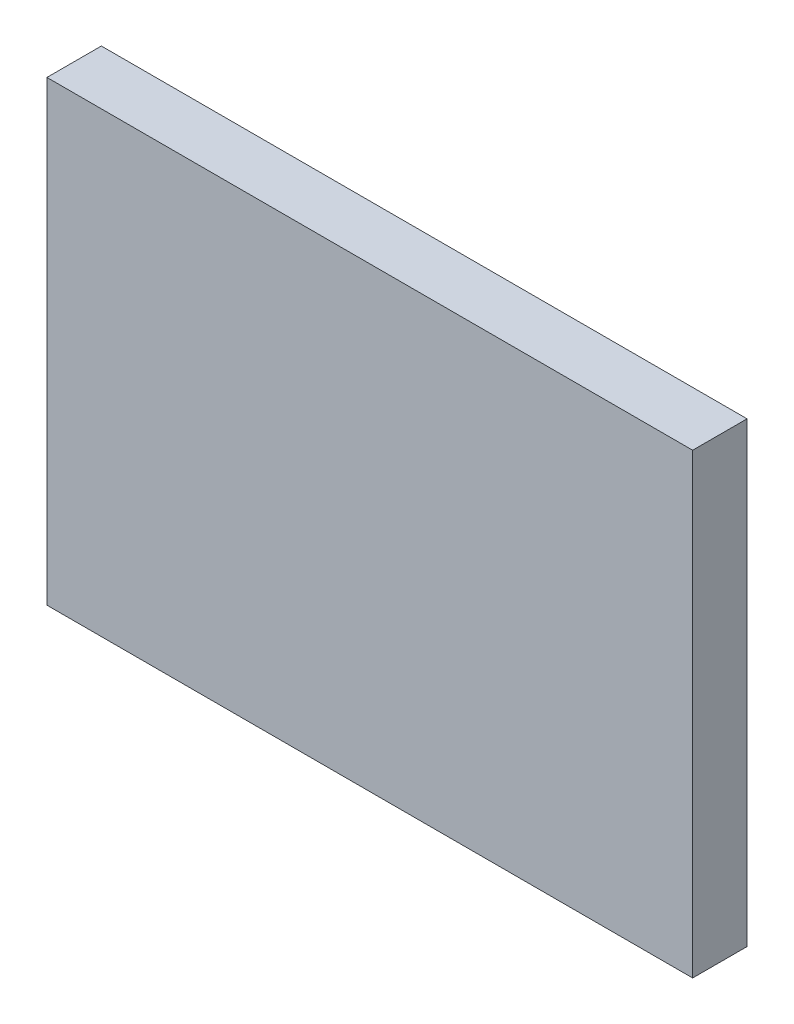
ISO-10303-21;
HEADER;
FILE_DESCRIPTION(('STEP AP214'),'2;1');
FILE_NAME('part.step','',(''),(''),'','','');
FILE_SCHEMA(('AUTOMOTIVE_DESIGN { 1 0 10303 214 1 1 1 1 }'));
ENDSEC;
DATA;
#1=APPLICATION_CONTEXT('core data for automotive mechanical design processes');
#2=APPLICATION_PROTOCOL_DEFINITION('international standard','automotive_design',2000,#1);
#3=PRODUCT_CONTEXT('',#1,'mechanical');
#4=PRODUCT('Part','Part','',(#3));
#5=PRODUCT_RELATED_PRODUCT_CATEGORY('part','',(#4));
#6=PRODUCT_DEFINITION_FORMATION('','',#4);
#7=PRODUCT_DEFINITION_CONTEXT('part definition',#1,'design');
#8=PRODUCT_DEFINITION('design','',#6,#7);
#9=PRODUCT_DEFINITION_SHAPE('','',#8);
#10=(LENGTH_UNIT() NAMED_UNIT(*) SI_UNIT(.MILLI.,.METRE.));
#11=(NAMED_UNIT(*) PLANE_ANGLE_UNIT() SI_UNIT($,.RADIAN.));
#12=(NAMED_UNIT(*) SI_UNIT($,.STERADIAN.) SOLID_ANGLE_UNIT());
#13=UNCERTAINTY_MEASURE_WITH_UNIT(LENGTH_MEASURE(1.E-05),#10,'distance_accuracy_value','');
#14=(GEOMETRIC_REPRESENTATION_CONTEXT(3) GLOBAL_UNCERTAINTY_ASSIGNED_CONTEXT((#13)) GLOBAL_UNIT_ASSIGNED_CONTEXT((#10,
#11,#12)) REPRESENTATION_CONTEXT('',''));
#15=CARTESIAN_POINT('',(0.,0.,0.));
#16=DIRECTION('',(0.,0.,1.));
#17=DIRECTION('',(1.,0.,0.));
#18=AXIS2_PLACEMENT_3D('',#15,#16,#17);
#19=CARTESIAN_POINT('',(17.8,12.6,3.));
#20=DIRECTION('',(-1.,0.,0.));
#21=DIRECTION('',(0.,-1.,0.));
#22=AXIS2_PLACEMENT_3D('',#19,#20,#21);
#23=PLANE('',#22);
#24=DIRECTION('',(0.,1.,0.));
#25=VECTOR('',#24,1.);
#26=CARTESIAN_POINT('',(17.8,12.6,0.));
#27=LINE('',#26,#25);
#28=CARTESIAN_POINT('',(17.8,-12.6,0.));
#29=VERTEX_POINT('',#28);
#30=CARTESIAN_POINT('',(17.8,12.6,0.));
#31=VERTEX_POINT('',#30);
#32=EDGE_CURVE('E95',#29,#31,#27,.T.);
#33=ORIENTED_EDGE('',*,*,#32,.T.);
#34=DIRECTION('',(0.,0.,-1.));
#35=VECTOR('',#34,1.);
#36=CARTESIAN_POINT('',(17.8,12.6,3.));
#37=LINE('',#36,#35);
#38=CARTESIAN_POINT('',(17.8,12.6,3.));
#39=VERTEX_POINT('',#38);
#40=EDGE_CURVE('E11',#39,#31,#37,.T.);
#41=ORIENTED_EDGE('',*,*,#40,.F.);
#42=DIRECTION('',(0.,1.,0.));
#43=VECTOR('',#42,1.);
#44=CARTESIAN_POINT('',(17.8,12.6,3.));
#45=LINE('',#44,#43);
#46=CARTESIAN_POINT('',(17.8,-12.6,3.));
#47=VERTEX_POINT('',#46);
#48=EDGE_CURVE('E83',#47,#39,#45,.T.);
#49=ORIENTED_EDGE('',*,*,#48,.F.);
#50=DIRECTION('',(0.,0.,-1.));
#51=VECTOR('',#50,1.);
#52=CARTESIAN_POINT('',(17.8,-12.6,3.));
#53=LINE('',#52,#51);
#54=EDGE_CURVE('E91',#47,#29,#53,.T.);
#55=ORIENTED_EDGE('',*,*,#54,.T.);
#56=EDGE_LOOP('',(#33,#41,#49,#55));
#57=FACE_BOUND('',#56,.T.);
#58=ADVANCED_FACE('F32',(#57),#23,.F.);
#59=CARTESIAN_POINT('',(-17.8,12.6,3.));
#60=DIRECTION('',(0.,-1.,0.));
#61=DIRECTION('',(0.,0.,-1.));
#62=AXIS2_PLACEMENT_3D('',#59,#60,#61);
#63=PLANE('',#62);
#64=DIRECTION('',(-1.,0.,0.));
#65=VECTOR('',#64,1.);
#66=CARTESIAN_POINT('',(-17.8,12.6,0.));
#67=LINE('',#66,#65);
#68=CARTESIAN_POINT('',(-17.8,12.6,0.));
#69=VERTEX_POINT('',#68);
#70=EDGE_CURVE('E87',#31,#69,#67,.T.);
#71=ORIENTED_EDGE('',*,*,#70,.T.);
#72=DIRECTION('',(0.,0.,-1.));
#73=VECTOR('',#72,1.);
#74=CARTESIAN_POINT('',(-17.8,12.6,3.));
#75=LINE('',#74,#73);
#76=CARTESIAN_POINT('',(-17.8,12.6,3.));
#77=VERTEX_POINT('',#76);
#78=EDGE_CURVE('E40',#77,#69,#75,.T.);
#79=ORIENTED_EDGE('',*,*,#78,.F.);
#80=DIRECTION('',(-1.,0.,0.));
#81=VECTOR('',#80,1.);
#82=CARTESIAN_POINT('',(-17.8,12.6,3.));
#83=LINE('',#82,#81);
#84=EDGE_CURVE('E78',#39,#77,#83,.T.);
#85=ORIENTED_EDGE('',*,*,#84,.F.);
#86=ORIENTED_EDGE('',*,*,#40,.T.);
#87=EDGE_LOOP('',(#71,#79,#85,#86));
#88=FACE_BOUND('',#87,.T.);
#89=ADVANCED_FACE('F86',(#88),#63,.F.);
#90=CARTESIAN_POINT('',(-17.8,12.6,3.));
#91=DIRECTION('',(1.,0.,0.));
#92=DIRECTION('',(0.,1.,0.));
#93=AXIS2_PLACEMENT_3D('',#90,#91,#92);
#94=PLANE('',#93);
#95=DIRECTION('',(0.,-1.,0.));
#96=VECTOR('',#95,1.);
#97=CARTESIAN_POINT('',(-17.8,12.6,0.));
#98=LINE('',#97,#96);
#99=CARTESIAN_POINT('',(-17.8,-12.6,0.));
#100=VERTEX_POINT('',#99);
#101=EDGE_CURVE('E65',#69,#100,#98,.T.);
#102=ORIENTED_EDGE('',*,*,#101,.T.);
#103=DIRECTION('',(0.,0.,-1.));
#104=VECTOR('',#103,1.);
#105=CARTESIAN_POINT('',(-17.8,-12.6,3.));
#106=LINE('',#105,#104);
#107=CARTESIAN_POINT('',(-17.8,-12.6,3.));
#108=VERTEX_POINT('',#107);
#109=EDGE_CURVE('E88',#108,#100,#106,.T.);
#110=ORIENTED_EDGE('',*,*,#109,.F.);
#111=DIRECTION('',(0.,-1.,0.));
#112=VECTOR('',#111,1.);
#113=CARTESIAN_POINT('',(-17.8,12.6,3.));
#114=LINE('',#113,#112);
#115=EDGE_CURVE('E81',#77,#108,#114,.T.);
#116=ORIENTED_EDGE('',*,*,#115,.F.);
#117=ORIENTED_EDGE('',*,*,#78,.T.);
#118=EDGE_LOOP('',(#102,#110,#116,#117));
#119=FACE_BOUND('',#118,.T.);
#120=ADVANCED_FACE('F89',(#119),#94,.F.);
#121=CARTESIAN_POINT('',(-17.8,-12.6,3.));
#122=DIRECTION('',(0.,1.,0.));
#123=DIRECTION('',(0.,0.,1.));
#124=AXIS2_PLACEMENT_3D('',#121,#122,#123);
#125=PLANE('',#124);
#126=DIRECTION('',(1.,0.,0.));
#127=VECTOR('',#126,1.);
#128=CARTESIAN_POINT('',(-17.8,-12.6,0.));
#129=LINE('',#128,#127);
#130=EDGE_CURVE('E71',#100,#29,#129,.T.);
#131=ORIENTED_EDGE('',*,*,#130,.T.);
#132=ORIENTED_EDGE('',*,*,#54,.F.);
#133=DIRECTION('',(1.,0.,0.));
#134=VECTOR('',#133,1.);
#135=CARTESIAN_POINT('',(-17.8,-12.6,3.));
#136=LINE('',#135,#134);
#137=EDGE_CURVE('E48',#108,#47,#136,.T.);
#138=ORIENTED_EDGE('',*,*,#137,.F.);
#139=ORIENTED_EDGE('',*,*,#109,.T.);
#140=EDGE_LOOP('',(#131,#132,#138,#139));
#141=FACE_BOUND('',#140,.T.);
#142=ADVANCED_FACE('F102',(#141),#125,.F.);
#143=CARTESIAN_POINT('',(0.,0.,3.));
#144=DIRECTION('',(0.,0.,1.));
#145=DIRECTION('',(1.,0.,0.));
#146=AXIS2_PLACEMENT_3D('',#143,#144,#145);
#147=PLANE('',#146);
#148=ORIENTED_EDGE('',*,*,#48,.T.);
#149=ORIENTED_EDGE('',*,*,#84,.T.);
#150=ORIENTED_EDGE('',*,*,#115,.T.);
#151=ORIENTED_EDGE('',*,*,#137,.T.);
#152=EDGE_LOOP('',(#148,#149,#150,#151));
#153=FACE_BOUND('',#152,.T.);
#154=ADVANCED_FACE('F79',(#153),#147,.T.);
#155=CARTESIAN_POINT('',(0.,0.,0.));
#156=DIRECTION('',(0.,0.,1.));
#157=DIRECTION('',(1.,0.,0.));
#158=AXIS2_PLACEMENT_3D('',#155,#156,#157);
#159=PLANE('',#158);
#160=ORIENTED_EDGE('',*,*,#32,.F.);
#161=ORIENTED_EDGE('',*,*,#130,.F.);
#162=ORIENTED_EDGE('',*,*,#101,.F.);
#163=ORIENTED_EDGE('',*,*,#70,.F.);
#164=EDGE_LOOP('',(#160,#161,#162,#163));
#165=FACE_BOUND('',#164,.T.);
#166=ADVANCED_FACE('F105',(#165),#159,.F.);
#167=CLOSED_SHELL('',(#58,#89,#120,#142,#154,#166));
#168=MANIFOLD_SOLID_BREP('B2',#167);
#169=ADVANCED_BREP_SHAPE_REPRESENTATION('',(#18,#168),#14);
#170=SHAPE_DEFINITION_REPRESENTATION(#9,#169);
ENDSEC;
END-ISO-10303-21;
